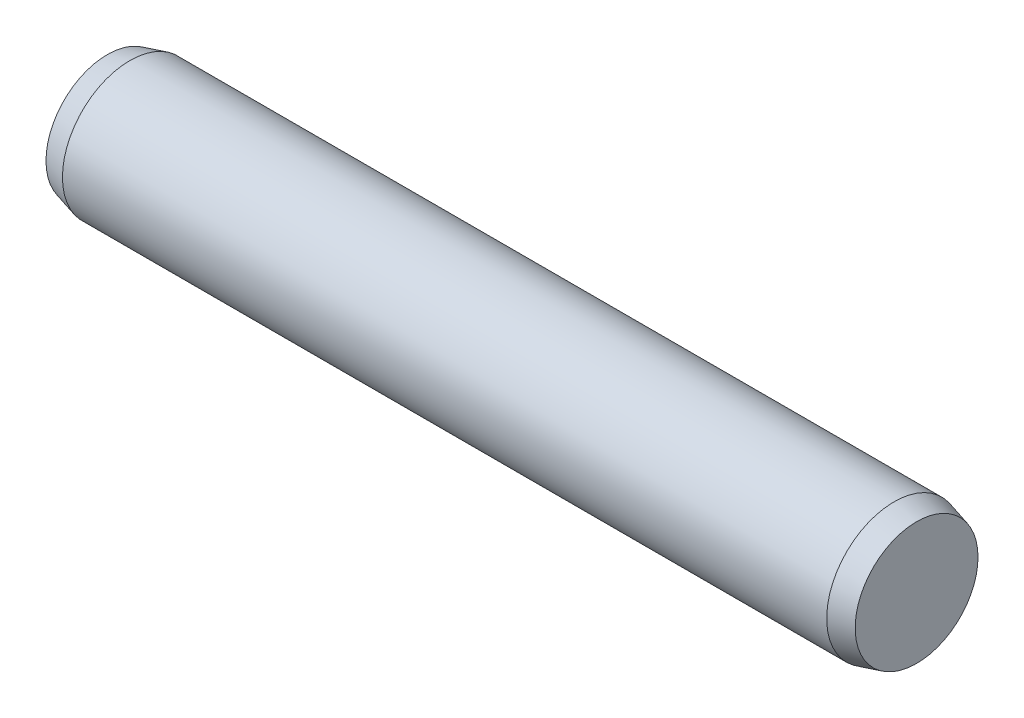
from build123d import *

# Parameters (mm, degrees)
EXTRUDE1_DEPTH      = 8.5
EXTRUDE1_DEPTH_BACK = 8.5
SKETCH2_R           = 1.5
SKETCH3_R           = 1.5
EXTRUDE2_DEPTH      = 0.5
EXTRUDE2_TAPER      = 15
SKETCH4_R           = 1.5
EXTRUDE3_DEPTH      = 0.5
EXTRUDE3_TAPER      = 15


with BuildPart() as part:
    # Sketch2 → Extrude1 (new, two sides: drawn at the far end of the back side and taken through both)
    with BuildSketch(Plane(origin=(0, 0, 0), x_dir=(0, 0, -1), z_dir=(1, 0, 0)).offset(-EXTRUDE1_DEPTH_BACK)):
        Circle(SKETCH2_R)
    extrude(amount=EXTRUDE1_DEPTH + EXTRUDE1_DEPTH_BACK)

    # Sketch3 → Extrude2 (add)
    with BuildSketch(Plane(origin=(8.5, 0, 0), x_dir=(0, 0, -1), z_dir=(1, 0, 0))):
        Circle(SKETCH3_R)
    extrude(amount=EXTRUDE2_DEPTH, taper=EXTRUDE2_TAPER)

    # Sketch4 → Extrude3 (add)
    with BuildSketch(Plane.ZY.offset(8.5)):
        with Locations(Location((0, 0, 0), (0, 0, 180))):
            Circle(SKETCH4_R)
    extrude(amount=EXTRUDE3_DEPTH, taper=EXTRUDE3_TAPER)


solid = part.part
